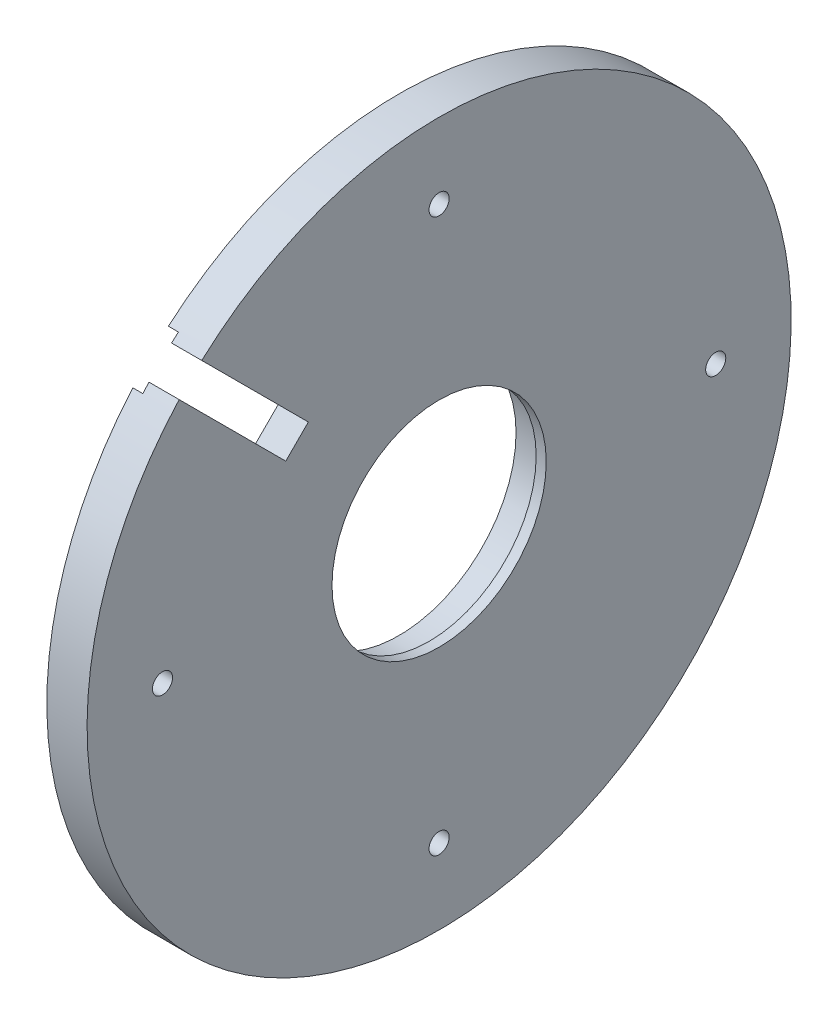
ISO-10303-21;
HEADER;
FILE_DESCRIPTION(('STEP AP214'),'2;1');
FILE_NAME('part.step','',(''),(''),'','','');
FILE_SCHEMA(('AUTOMOTIVE_DESIGN { 1 0 10303 214 1 1 1 1 }'));
ENDSEC;
DATA;
#1=APPLICATION_CONTEXT('core data for automotive mechanical design processes');
#2=APPLICATION_PROTOCOL_DEFINITION('international standard','automotive_design',2000,#1);
#3=PRODUCT_CONTEXT('',#1,'mechanical');
#4=PRODUCT('Part','Part','',(#3));
#5=PRODUCT_RELATED_PRODUCT_CATEGORY('part','',(#4));
#6=PRODUCT_DEFINITION_FORMATION('','',#4);
#7=PRODUCT_DEFINITION_CONTEXT('part definition',#1,'design');
#8=PRODUCT_DEFINITION('design','',#6,#7);
#9=PRODUCT_DEFINITION_SHAPE('','',#8);
#10=(LENGTH_UNIT() NAMED_UNIT(*) SI_UNIT(.MILLI.,.METRE.));
#11=(NAMED_UNIT(*) PLANE_ANGLE_UNIT() SI_UNIT($,.RADIAN.));
#12=(NAMED_UNIT(*) SI_UNIT($,.STERADIAN.) SOLID_ANGLE_UNIT());
#13=UNCERTAINTY_MEASURE_WITH_UNIT(LENGTH_MEASURE(1.E-05),#10,'distance_accuracy_value','');
#14=(GEOMETRIC_REPRESENTATION_CONTEXT(3) GLOBAL_UNCERTAINTY_ASSIGNED_CONTEXT((#13)) GLOBAL_UNIT_ASSIGNED_CONTEXT((#10,
#11,#12)) REPRESENTATION_CONTEXT('',''));
#15=CARTESIAN_POINT('',(0.,0.,0.));
#16=DIRECTION('',(0.,0.,1.));
#17=DIRECTION('',(1.,0.,0.));
#18=AXIS2_PLACEMENT_3D('',#15,#16,#17);
#19=CARTESIAN_POINT('',(3.,23.4767178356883,24.9582128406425));
#20=DIRECTION('',(-1.,0.,0.));
#21=DIRECTION('',(0.,0.,1.));
#22=AXIS2_PLACEMENT_3D('',#19,#20,#21);
#23=PLANE('',#22);
#24=CARTESIAN_POINT('',(3.,23.4767178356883,24.9582128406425));
#25=DIRECTION('',(-1.,0.,0.));
#26=DIRECTION('',(0.,0.,1.));
#27=AXIS2_PLACEMENT_3D('',#24,#25,#26);
#28=CIRCLE('',#27,10.6500000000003);
#29=CARTESIAN_POINT('',(3.,23.4767178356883,35.6082128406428));
#30=VERTEX_POINT('',#29);
#31=EDGE_CURVE('E169',#30,#30,#28,.T.);
#32=ORIENTED_EDGE('',*,*,#31,.F.);
#33=EDGE_LOOP('',(#32));
#34=FACE_BOUND('',#33,.T.);
#35=CARTESIAN_POINT('',(3.,23.4767178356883,24.9582128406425));
#36=DIRECTION('',(-1.,0.,0.));
#37=DIRECTION('',(0.,0.,1.));
#38=AXIS2_PLACEMENT_3D('',#35,#36,#37);
#39=CIRCLE('',#38,11.1500000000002);
#40=CARTESIAN_POINT('',(3.,23.4767178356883,36.1082128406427));
#41=VERTEX_POINT('',#40);
#42=EDGE_CURVE('E162',#41,#41,#39,.T.);
#43=ORIENTED_EDGE('',*,*,#42,.T.);
#44=EDGE_LOOP('',(#43));
#45=FACE_BOUND('',#44,.T.);
#46=ADVANCED_FACE('F33',(#34,#45),#23,.T.);
#47=CARTESIAN_POINT('',(4.,23.4767178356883,24.9582128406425));
#48=DIRECTION('',(1.,0.,0.));
#49=DIRECTION('',(0.,0.,-1.));
#50=AXIS2_PLACEMENT_3D('',#47,#48,#49);
#51=PLANE('',#50);
#52=DIRECTION('',(0.,-0.707106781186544,-0.707106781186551));
#53=VECTOR('',#52,1.);
#54=CARTESIAN_POINT('',(4.,36.4963214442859,40.2228804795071));
#55=LINE('',#54,#53);
#56=CARTESIAN_POINT('',(4.,47.0774526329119,50.8040116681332));
#57=VERTEX_POINT('',#56);
#58=CARTESIAN_POINT('',(4.,36.4963214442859,40.2228804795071));
#59=VERTEX_POINT('',#58);
#60=EDGE_CURVE('E117',#57,#59,#55,.T.);
#61=ORIENTED_EDGE('',*,*,#60,.F.);
#62=CARTESIAN_POINT('',(4.,23.4767178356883,24.9582128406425));
#63=DIRECTION('',(1.,0.,0.));
#64=DIRECTION('',(0.,0.,-1.));
#65=AXIS2_PLACEMENT_3D('',#62,#63,#64);
#66=CIRCLE('',#65,35.);
#67=CARTESIAN_POINT('',(4.,49.3225166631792,48.5589476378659));
#68=VERTEX_POINT('',#67);
#69=EDGE_CURVE('E194',#57,#68,#66,.T.);
#70=ORIENTED_EDGE('',*,*,#69,.T.);
#71=DIRECTION('',(0.,0.707106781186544,0.707106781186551));
#72=VECTOR('',#71,1.);
#73=CARTESIAN_POINT('',(4.,38.7413854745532,37.9778164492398));
#74=LINE('',#73,#72);
#75=CARTESIAN_POINT('',(4.,38.7236967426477,37.9601277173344));
#76=VERTEX_POINT('',#75);
#77=EDGE_CURVE('E124',#76,#68,#74,.T.);
#78=ORIENTED_EDGE('',*,*,#77,.F.);
#79=DIRECTION('',(0.,0.707106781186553,-0.707106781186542));
#80=VECTOR('',#79,1.);
#81=CARTESIAN_POINT('',(4.,36.4781181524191,40.205706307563));
#82=LINE('',#81,#80);
#83=CARTESIAN_POINT('',(4.,36.4781181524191,40.205706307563));
#84=VERTEX_POINT('',#83);
#85=EDGE_CURVE('E114',#84,#76,#82,.T.);
#86=ORIENTED_EDGE('',*,*,#85,.F.);
#87=DIRECTION('',(0.,-0.72736861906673,-0.686246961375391));
#88=VECTOR('',#87,1.);
#89=CARTESIAN_POINT('',(4.,36.4781181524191,40.205706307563));
#90=LINE('',#89,#88);
#91=EDGE_CURVE('E109',#59,#84,#90,.T.);
#92=ORIENTED_EDGE('',*,*,#91,.F.);
#93=EDGE_LOOP('',(#61,#70,#78,#86,#92));
#94=FACE_BOUND('',#93,.T.);
#95=CARTESIAN_POINT('',(4.,50.9767178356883,24.9582128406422));
#96=DIRECTION('',(1.,0.,0.));
#97=DIRECTION('',(0.,0.,-1.));
#98=AXIS2_PLACEMENT_3D('',#95,#96,#97);
#99=CIRCLE('',#98,1.);
#100=CARTESIAN_POINT('',(4.,50.9767178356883,23.9582128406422));
#101=VERTEX_POINT('',#100);
#102=EDGE_CURVE('E172',#101,#101,#99,.T.);
#103=ORIENTED_EDGE('',*,*,#102,.F.);
#104=EDGE_LOOP('',(#103));
#105=FACE_BOUND('',#104,.T.);
#106=CARTESIAN_POINT('',(4.,23.4767178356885,52.4582128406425));
#107=DIRECTION('',(1.,0.,0.));
#108=DIRECTION('',(0.,0.,-1.));
#109=AXIS2_PLACEMENT_3D('',#106,#107,#108);
#110=CIRCLE('',#109,0.999999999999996);
#111=CARTESIAN_POINT('',(4.,23.4767178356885,51.4582128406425));
#112=VERTEX_POINT('',#111);
#113=EDGE_CURVE('E178',#112,#112,#110,.T.);
#114=ORIENTED_EDGE('',*,*,#113,.F.);
#115=EDGE_LOOP('',(#114));
#116=FACE_BOUND('',#115,.T.);
#117=CARTESIAN_POINT('',(4.,-4.02328216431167,24.9582128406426));
#118=DIRECTION('',(1.,0.,0.));
#119=DIRECTION('',(0.,0.,-1.));
#120=AXIS2_PLACEMENT_3D('',#117,#118,#119);
#121=CIRCLE('',#120,1.);
#122=CARTESIAN_POINT('',(4.,-4.02328216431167,23.9582128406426));
#123=VERTEX_POINT('',#122);
#124=EDGE_CURVE('E182',#123,#123,#121,.T.);
#125=ORIENTED_EDGE('',*,*,#124,.F.);
#126=EDGE_LOOP('',(#125));
#127=FACE_BOUND('',#126,.T.);
#128=CARTESIAN_POINT('',(4.,23.4767178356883,-2.54178715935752));
#129=DIRECTION('',(1.,0.,0.));
#130=DIRECTION('',(0.,0.,-1.));
#131=AXIS2_PLACEMENT_3D('',#128,#129,#130);
#132=CIRCLE('',#131,1.);
#133=CARTESIAN_POINT('',(4.,23.4767178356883,-3.54178715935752));
#134=VERTEX_POINT('',#133);
#135=EDGE_CURVE('E186',#134,#134,#132,.T.);
#136=ORIENTED_EDGE('',*,*,#135,.F.);
#137=EDGE_LOOP('',(#136));
#138=FACE_BOUND('',#137,.T.);
#139=CARTESIAN_POINT('',(4.,23.4767178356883,24.9582128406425));
#140=DIRECTION('',(-1.,0.,0.));
#141=DIRECTION('',(0.,0.,1.));
#142=AXIS2_PLACEMENT_3D('',#139,#140,#141);
#143=CIRCLE('',#142,10.6500000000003);
#144=CARTESIAN_POINT('',(4.,23.4767178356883,35.6082128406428));
#145=VERTEX_POINT('',#144);
#146=EDGE_CURVE('E168',#145,#145,#143,.T.);
#147=ORIENTED_EDGE('',*,*,#146,.T.);
#148=EDGE_LOOP('',(#147));
#149=FACE_BOUND('',#148,.T.);
#150=ADVANCED_FACE('F126',(#94,#105,#116,#127,#138,#149),#51,.T.);
#151=CARTESIAN_POINT('',(0.,23.4767178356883,24.9582128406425));
#152=DIRECTION('',(1.,0.,0.));
#153=DIRECTION('',(0.,0.,-1.));
#154=AXIS2_PLACEMENT_3D('',#151,#152,#153);
#155=PLANE('',#154);
#156=CARTESIAN_POINT('',(0.,50.9767178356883,24.9582128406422));
#157=DIRECTION('',(1.,0.,0.));
#158=DIRECTION('',(0.,0.,-1.));
#159=AXIS2_PLACEMENT_3D('',#156,#157,#158);
#160=CIRCLE('',#159,1.);
#161=CARTESIAN_POINT('',(0.,50.9767178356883,23.9582128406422));
#162=VERTEX_POINT('',#161);
#163=EDGE_CURVE('E177',#162,#162,#160,.T.);
#164=ORIENTED_EDGE('',*,*,#163,.T.);
#165=EDGE_LOOP('',(#164));
#166=FACE_BOUND('',#165,.T.);
#167=CARTESIAN_POINT('',(0.,23.4767178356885,52.4582128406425));
#168=DIRECTION('',(1.,0.,0.));
#169=DIRECTION('',(0.,0.,-1.));
#170=AXIS2_PLACEMENT_3D('',#167,#168,#169);
#171=CIRCLE('',#170,0.999999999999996);
#172=CARTESIAN_POINT('',(0.,23.4767178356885,51.4582128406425));
#173=VERTEX_POINT('',#172);
#174=EDGE_CURVE('E181',#173,#173,#171,.T.);
#175=ORIENTED_EDGE('',*,*,#174,.T.);
#176=EDGE_LOOP('',(#175));
#177=FACE_BOUND('',#176,.T.);
#178=CARTESIAN_POINT('',(0.,-4.02328216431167,24.9582128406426));
#179=DIRECTION('',(1.,0.,0.));
#180=DIRECTION('',(0.,0.,-1.));
#181=AXIS2_PLACEMENT_3D('',#178,#179,#180);
#182=CIRCLE('',#181,1.);
#183=CARTESIAN_POINT('',(0.,-4.02328216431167,23.9582128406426));
#184=VERTEX_POINT('',#183);
#185=EDGE_CURVE('E185',#184,#184,#182,.T.);
#186=ORIENTED_EDGE('',*,*,#185,.T.);
#187=EDGE_LOOP('',(#186));
#188=FACE_BOUND('',#187,.T.);
#189=CARTESIAN_POINT('',(0.,23.4767178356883,-2.54178715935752));
#190=DIRECTION('',(1.,0.,0.));
#191=DIRECTION('',(0.,0.,-1.));
#192=AXIS2_PLACEMENT_3D('',#189,#190,#191);
#193=CIRCLE('',#192,1.);
#194=CARTESIAN_POINT('',(0.,23.4767178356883,-3.54178715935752));
#195=VERTEX_POINT('',#194);
#196=EDGE_CURVE('E189',#195,#195,#193,.T.);
#197=ORIENTED_EDGE('',*,*,#196,.T.);
#198=EDGE_LOOP('',(#197));
#199=FACE_BOUND('',#198,.T.);
#200=DIRECTION('',(0.,-0.707106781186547,0.707106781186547));
#201=VECTOR('',#200,1.);
#202=CARTESIAN_POINT('',(0.,37.6011647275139,35.5471258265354));
#203=LINE('',#202,#201);
#204=CARTESIAN_POINT('',(0.,37.6011647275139,35.5471258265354));
#205=VERTEX_POINT('',#204);
#206=CARTESIAN_POINT('',(0.,34.0656308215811,39.0826597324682));
#207=VERTEX_POINT('',#206);
#208=EDGE_CURVE('E140',#205,#207,#203,.T.);
#209=ORIENTED_EDGE('',*,*,#208,.F.);
#210=DIRECTION('',(0.,-0.707106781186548,-0.707106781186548));
#211=VECTOR('',#210,1.);
#212=CARTESIAN_POINT('',(0.,38.3082715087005,36.254232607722));
#213=LINE('',#212,#211);
#214=CARTESIAN_POINT('',(0.,49.9300068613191,47.8759679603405));
#215=VERTEX_POINT('',#214);
#216=EDGE_CURVE('E144',#215,#205,#213,.T.);
#217=ORIENTED_EDGE('',*,*,#216,.F.);
#218=CARTESIAN_POINT('',(0.,23.4767178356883,24.9582128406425));
#219=DIRECTION('',(1.,0.,0.));
#220=DIRECTION('',(0.,0.,-1.));
#221=AXIS2_PLACEMENT_3D('',#218,#219,#220);
#222=CIRCLE('',#221,35.);
#223=CARTESIAN_POINT('',(0.,46.3944729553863,51.4115018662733));
#224=VERTEX_POINT('',#223);
#225=EDGE_CURVE('E193',#224,#215,#222,.T.);
#226=ORIENTED_EDGE('',*,*,#225,.F.);
#227=DIRECTION('',(0.,0.707106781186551,0.707106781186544));
#228=VECTOR('',#227,1.);
#229=CARTESIAN_POINT('',(0.,47.5082448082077,52.5252737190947));
#230=LINE('',#229,#228);
#231=EDGE_CURVE('E152',#207,#224,#230,.T.);
#232=ORIENTED_EDGE('',*,*,#231,.F.);
#233=EDGE_LOOP('',(#209,#217,#226,#232));
#234=FACE_BOUND('',#233,.T.);
#235=CARTESIAN_POINT('',(0.,23.4767178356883,24.9582128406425));
#236=DIRECTION('',(1.,0.,0.));
#237=DIRECTION('',(0.,0.,-1.));
#238=AXIS2_PLACEMENT_3D('',#235,#236,#237);
#239=CIRCLE('',#238,11.6500000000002);
#240=CARTESIAN_POINT('',(0.,23.4767178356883,13.3082128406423));
#241=VERTEX_POINT('',#240);
#242=EDGE_CURVE('E190',#241,#241,#239,.T.);
#243=ORIENTED_EDGE('',*,*,#242,.T.);
#244=EDGE_LOOP('',(#243));
#245=FACE_BOUND('',#244,.T.);
#246=ADVANCED_FACE('F239',(#166,#177,#188,#199,#234,#245),#155,.F.);
#247=CARTESIAN_POINT('',(4.,23.4767178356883,24.9582128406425));
#248=DIRECTION('',(-1.,0.,0.));
#249=DIRECTION('',(0.,0.,1.));
#250=AXIS2_PLACEMENT_3D('',#247,#248,#249);
#251=CYLINDRICAL_SURFACE('',#250,35.);
#252=ORIENTED_EDGE('',*,*,#69,.F.);
#253=DIRECTION('',(-1.,0.,0.));
#254=VECTOR('',#253,1.);
#255=CARTESIAN_POINT('',(4.,47.0774526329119,50.8040116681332));
#256=LINE('',#255,#254);
#257=CARTESIAN_POINT('',(1.,47.0774526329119,50.8040116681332));
#258=VERTEX_POINT('',#257);
#259=EDGE_CURVE('E120',#57,#258,#256,.T.);
#260=ORIENTED_EDGE('',*,*,#259,.T.);
#261=CARTESIAN_POINT('',(1.,23.4767178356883,24.9582128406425));
#262=DIRECTION('',(-1.,0.,0.));
#263=DIRECTION('',(0.,0.,1.));
#264=AXIS2_PLACEMENT_3D('',#261,#262,#263);
#265=CIRCLE('',#264,35.);
#266=CARTESIAN_POINT('',(1.,46.3944729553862,51.4115018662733));
#267=VERTEX_POINT('',#266);
#268=EDGE_CURVE('E161',#267,#258,#265,.T.);
#269=ORIENTED_EDGE('',*,*,#268,.F.);
#270=DIRECTION('',(-1.,0.,0.));
#271=VECTOR('',#270,1.);
#272=CARTESIAN_POINT('',(4.,46.3944729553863,51.4115018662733));
#273=LINE('',#272,#271);
#274=EDGE_CURVE('E56',#267,#224,#273,.T.);
#275=ORIENTED_EDGE('',*,*,#274,.T.);
#276=ORIENTED_EDGE('',*,*,#225,.T.);
#277=DIRECTION('',(-1.,0.,0.));
#278=VECTOR('',#277,1.);
#279=CARTESIAN_POINT('',(4.,49.9300068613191,47.8759679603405));
#280=LINE('',#279,#278);
#281=CARTESIAN_POINT('',(1.,49.930006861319,47.8759679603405));
#282=VERTEX_POINT('',#281);
#283=EDGE_CURVE('E212',#215,#282,#280,.F.);
#284=ORIENTED_EDGE('',*,*,#283,.T.);
#285=CARTESIAN_POINT('',(1.,49.3225166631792,48.5589476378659));
#286=VERTEX_POINT('',#285);
#287=EDGE_CURVE('E157',#286,#282,#265,.T.);
#288=ORIENTED_EDGE('',*,*,#287,.F.);
#289=DIRECTION('',(-1.,0.,0.));
#290=VECTOR('',#289,1.);
#291=CARTESIAN_POINT('',(4.,49.3225166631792,48.5589476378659));
#292=LINE('',#291,#290);
#293=EDGE_CURVE('E48',#286,#68,#292,.F.);
#294=ORIENTED_EDGE('',*,*,#293,.T.);
#295=EDGE_LOOP('',(#252,#260,#269,#275,#276,#284,#288,#294));
#296=FACE_BOUND('',#295,.T.);
#297=ADVANCED_FACE('F228',(#296),#251,.T.);
#298=CARTESIAN_POINT('',(4.,23.4767178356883,24.9582128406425));
#299=DIRECTION('',(-1.,0.,0.));
#300=DIRECTION('',(0.,0.,1.));
#301=AXIS2_PLACEMENT_3D('',#298,#299,#300);
#302=CYLINDRICAL_SURFACE('',#301,11.6500000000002);
#303=ORIENTED_EDGE('',*,*,#242,.F.);
#304=EDGE_LOOP('',(#303));
#305=FACE_BOUND('',#304,.T.);
#306=CARTESIAN_POINT('',(3.25,23.4767178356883,24.9582128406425));
#307=DIRECTION('',(-1.,0.,0.));
#308=DIRECTION('',(0.,0.,1.));
#309=AXIS2_PLACEMENT_3D('',#306,#307,#308);
#310=CIRCLE('',#309,11.6500000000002);
#311=CARTESIAN_POINT('',(3.25,23.4767178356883,36.6082128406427));
#312=VERTEX_POINT('',#311);
#313=EDGE_CURVE('E165',#312,#312,#310,.T.);
#314=ORIENTED_EDGE('',*,*,#313,.F.);
#315=EDGE_LOOP('',(#314));
#316=FACE_BOUND('',#315,.T.);
#317=ADVANCED_FACE('F283',(#305,#316),#302,.F.);
#318=CARTESIAN_POINT('',(-6.,23.4767178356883,-2.54178715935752));
#319=DIRECTION('',(1.,0.,0.));
#320=DIRECTION('',(0.,0.,-1.));
#321=AXIS2_PLACEMENT_3D('',#318,#319,#320);
#322=CYLINDRICAL_SURFACE('',#321,1.);
#323=ORIENTED_EDGE('',*,*,#135,.T.);
#324=EDGE_LOOP('',(#323));
#325=FACE_BOUND('',#324,.T.);
#326=ORIENTED_EDGE('',*,*,#196,.F.);
#327=EDGE_LOOP('',(#326));
#328=FACE_BOUND('',#327,.T.);
#329=ADVANCED_FACE('F279',(#325,#328),#322,.F.);
#330=CARTESIAN_POINT('',(-6.,-4.02328216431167,24.9582128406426));
#331=DIRECTION('',(1.,0.,0.));
#332=DIRECTION('',(0.,0.,-1.));
#333=AXIS2_PLACEMENT_3D('',#330,#331,#332);
#334=CYLINDRICAL_SURFACE('',#333,1.);
#335=ORIENTED_EDGE('',*,*,#124,.T.);
#336=EDGE_LOOP('',(#335));
#337=FACE_BOUND('',#336,.T.);
#338=ORIENTED_EDGE('',*,*,#185,.F.);
#339=EDGE_LOOP('',(#338));
#340=FACE_BOUND('',#339,.T.);
#341=ADVANCED_FACE('F275',(#337,#340),#334,.F.);
#342=CARTESIAN_POINT('',(-6.,23.4767178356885,52.4582128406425));
#343=DIRECTION('',(1.,0.,0.));
#344=DIRECTION('',(0.,0.,-1.));
#345=AXIS2_PLACEMENT_3D('',#342,#343,#344);
#346=CYLINDRICAL_SURFACE('',#345,0.999999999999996);
#347=ORIENTED_EDGE('',*,*,#113,.T.);
#348=EDGE_LOOP('',(#347));
#349=FACE_BOUND('',#348,.T.);
#350=ORIENTED_EDGE('',*,*,#174,.F.);
#351=EDGE_LOOP('',(#350));
#352=FACE_BOUND('',#351,.T.);
#353=ADVANCED_FACE('F271',(#349,#352),#346,.F.);
#354=CARTESIAN_POINT('',(-6.,50.9767178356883,24.9582128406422));
#355=DIRECTION('',(1.,0.,0.));
#356=DIRECTION('',(0.,0.,-1.));
#357=AXIS2_PLACEMENT_3D('',#354,#355,#356);
#358=CYLINDRICAL_SURFACE('',#357,1.);
#359=ORIENTED_EDGE('',*,*,#102,.T.);
#360=EDGE_LOOP('',(#359));
#361=FACE_BOUND('',#360,.T.);
#362=ORIENTED_EDGE('',*,*,#163,.F.);
#363=EDGE_LOOP('',(#362));
#364=FACE_BOUND('',#363,.T.);
#365=ADVANCED_FACE('F268',(#361,#364),#358,.F.);
#366=CARTESIAN_POINT('',(3.,23.4767178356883,24.9582128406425));
#367=DIRECTION('',(1.,0.,0.));
#368=DIRECTION('',(0.,0.,-1.));
#369=AXIS2_PLACEMENT_3D('',#366,#367,#368);
#370=CYLINDRICAL_SURFACE('',#369,10.6500000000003);
#371=ORIENTED_EDGE('',*,*,#31,.T.);
#372=EDGE_LOOP('',(#371));
#373=FACE_BOUND('',#372,.T.);
#374=ORIENTED_EDGE('',*,*,#146,.F.);
#375=EDGE_LOOP('',(#374));
#376=FACE_BOUND('',#375,.T.);
#377=ADVANCED_FACE('F266',(#373,#376),#370,.F.);
#378=CARTESIAN_POINT('',(3.25,23.4767178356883,24.9582128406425));
#379=DIRECTION('',(-1.,0.,0.));
#380=DIRECTION('',(0.,0.,1.));
#381=AXIS2_PLACEMENT_3D('',#378,#379,#380);
#382=PLANE('',#381);
#383=CARTESIAN_POINT('',(3.25,23.4767178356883,24.9582128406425));
#384=DIRECTION('',(-1.,0.,0.));
#385=DIRECTION('',(0.,0.,1.));
#386=AXIS2_PLACEMENT_3D('',#383,#384,#385);
#387=CIRCLE('',#386,11.2500000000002);
#388=CARTESIAN_POINT('',(3.25,23.4767178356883,36.2082128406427));
#389=VERTEX_POINT('',#388);
#390=EDGE_CURVE('E209',#389,#389,#387,.F.);
#391=ORIENTED_EDGE('',*,*,#390,.T.);
#392=EDGE_LOOP('',(#391));
#393=FACE_BOUND('',#392,.T.);
#394=ORIENTED_EDGE('',*,*,#313,.T.);
#395=EDGE_LOOP('',(#394));
#396=FACE_BOUND('',#395,.T.);
#397=ADVANCED_FACE('F324',(#393,#396),#382,.T.);
#398=CARTESIAN_POINT('',(3.25,23.4767178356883,24.9582128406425));
#399=DIRECTION('',(-1.,0.,0.));
#400=DIRECTION('',(0.,0.,1.));
#401=AXIS2_PLACEMENT_3D('',#398,#399,#400);
#402=CYLINDRICAL_SURFACE('',#401,11.1500000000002);
#403=CARTESIAN_POINT('',(3.15,23.4767178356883,24.9582128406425));
#404=DIRECTION('',(-1.,0.,0.));
#405=DIRECTION('',(0.,0.,1.));
#406=AXIS2_PLACEMENT_3D('',#403,#404,#405);
#407=CIRCLE('',#406,11.1500000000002);
#408=CARTESIAN_POINT('',(3.15,23.4767178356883,36.1082128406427));
#409=VERTEX_POINT('',#408);
#410=EDGE_CURVE('E196',#409,#409,#407,.T.);
#411=ORIENTED_EDGE('',*,*,#410,.T.);
#412=EDGE_LOOP('',(#411));
#413=FACE_BOUND('',#412,.T.);
#414=ORIENTED_EDGE('',*,*,#42,.F.);
#415=EDGE_LOOP('',(#414));
#416=FACE_BOUND('',#415,.T.);
#417=ADVANCED_FACE('F330',(#413,#416),#402,.T.);
#418=CARTESIAN_POINT('',(3.15,23.4767178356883,24.9582128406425));
#419=DIRECTION('',(-1.,0.,0.));
#420=DIRECTION('',(0.,0.,1.));
#421=AXIS2_PLACEMENT_3D('',#418,#419,#420);
#422=TOROIDAL_SURFACE('',#421,11.2500000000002,0.1);
#423=ORIENTED_EDGE('',*,*,#390,.F.);
#424=EDGE_LOOP('',(#423));
#425=FACE_BOUND('',#424,.T.);
#426=ORIENTED_EDGE('',*,*,#410,.F.);
#427=EDGE_LOOP('',(#426));
#428=FACE_BOUND('',#427,.T.);
#429=ADVANCED_FACE('F35',(#425,#428),#422,.F.);
#430=CARTESIAN_POINT('',(1.,38.3082715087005,36.254232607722));
#431=DIRECTION('',(0.,0.707106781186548,-0.707106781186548));
#432=DIRECTION('',(0.,0.707106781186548,0.707106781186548));
#433=AXIS2_PLACEMENT_3D('',#430,#431,#432);
#434=PLANE('',#433);
#435=ORIENTED_EDGE('',*,*,#216,.T.);
#436=DIRECTION('',(-1.,0.,0.));
#437=VECTOR('',#436,1.);
#438=CARTESIAN_POINT('',(1.,37.6011647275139,35.5471258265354));
#439=LINE('',#438,#437);
#440=CARTESIAN_POINT('',(1.,37.6011647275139,35.5471258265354));
#441=VERTEX_POINT('',#440);
#442=EDGE_CURVE('E149',#441,#205,#439,.T.);
#443=ORIENTED_EDGE('',*,*,#442,.F.);
#444=DIRECTION('',(0.,-0.707106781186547,-0.707106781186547));
#445=VECTOR('',#444,1.);
#446=CARTESIAN_POINT('',(1.,38.3082715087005,36.254232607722));
#447=LINE('',#446,#445);
#448=EDGE_CURVE('E141',#282,#441,#447,.T.);
#449=ORIENTED_EDGE('',*,*,#448,.F.);
#450=ORIENTED_EDGE('',*,*,#283,.F.);
#451=EDGE_LOOP('',(#435,#443,#449,#450));
#452=FACE_BOUND('',#451,.T.);
#453=ADVANCED_FACE('F235',(#452),#434,.F.);
#454=CARTESIAN_POINT('',(1.,47.5082448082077,52.5252737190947));
#455=DIRECTION('',(0.,-0.707106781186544,0.707106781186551));
#456=DIRECTION('',(0.,-0.707106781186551,-0.707106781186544));
#457=AXIS2_PLACEMENT_3D('',#454,#455,#456);
#458=PLANE('',#457);
#459=DIRECTION('',(0.,0.707106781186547,0.707106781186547));
#460=VECTOR('',#459,1.);
#461=CARTESIAN_POINT('',(1.,34.7727376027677,39.7897665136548));
#462=LINE('',#461,#460);
#463=CARTESIAN_POINT('',(1.,34.0656308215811,39.0826597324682));
#464=VERTEX_POINT('',#463);
#465=EDGE_CURVE('E147',#464,#267,#462,.T.);
#466=ORIENTED_EDGE('',*,*,#465,.F.);
#467=DIRECTION('',(-1.,0.,0.));
#468=VECTOR('',#467,1.);
#469=CARTESIAN_POINT('',(1.,34.0656308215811,39.0826597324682));
#470=LINE('',#469,#468);
#471=EDGE_CURVE('E155',#464,#207,#470,.T.);
#472=ORIENTED_EDGE('',*,*,#471,.T.);
#473=ORIENTED_EDGE('',*,*,#231,.T.);
#474=ORIENTED_EDGE('',*,*,#274,.F.);
#475=EDGE_LOOP('',(#466,#472,#473,#474));
#476=FACE_BOUND('',#475,.T.);
#477=ADVANCED_FACE('F245',(#476),#458,.F.);
#478=CARTESIAN_POINT('',(1.,37.6011647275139,35.5471258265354));
#479=DIRECTION('',(-1.,0.,0.));
#480=DIRECTION('',(0.,0.,1.));
#481=AXIS2_PLACEMENT_3D('',#478,#479,#480);
#482=PLANE('',#481);
#483=DIRECTION('',(0.,0.707106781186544,0.707106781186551));
#484=VECTOR('',#483,1.);
#485=CARTESIAN_POINT('',(1.,34.7108657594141,38.4374247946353));
#486=LINE('',#485,#484);
#487=CARTESIAN_POINT('',(1.,36.4963214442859,40.2228804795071));
#488=VERTEX_POINT('',#487);
#489=EDGE_CURVE('E11',#488,#258,#486,.T.);
#490=ORIENTED_EDGE('',*,*,#489,.F.);
#491=DIRECTION('',(0.,0.72736861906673,0.686246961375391));
#492=VECTOR('',#491,1.);
#493=CARTESIAN_POINT('',(1.,34.7469314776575,38.5723919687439));
#494=LINE('',#493,#492);
#495=CARTESIAN_POINT('',(1.,36.4781181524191,40.205706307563));
#496=VERTEX_POINT('',#495);
#497=EDGE_CURVE('E41',#496,#488,#494,.T.);
#498=ORIENTED_EDGE('',*,*,#497,.F.);
#499=DIRECTION('',(0.,-0.707106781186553,0.707106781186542));
#500=VECTOR('',#499,1.);
#501=CARTESIAN_POINT('',(1.,39.3689316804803,37.3148927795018));
#502=LINE('',#501,#500);
#503=CARTESIAN_POINT('',(1.,38.7236967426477,37.9601277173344));
#504=VERTEX_POINT('',#503);
#505=EDGE_CURVE('E218',#504,#496,#502,.T.);
#506=ORIENTED_EDGE('',*,*,#505,.F.);
#507=DIRECTION('',(0.,-0.707106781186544,-0.707106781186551));
#508=VECTOR('',#507,1.);
#509=CARTESIAN_POINT('',(1.,36.9559297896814,36.192360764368));
#510=LINE('',#509,#508);
#511=EDGE_CURVE('E216',#286,#504,#510,.T.);
#512=ORIENTED_EDGE('',*,*,#511,.F.);
#513=ORIENTED_EDGE('',*,*,#287,.T.);
#514=ORIENTED_EDGE('',*,*,#448,.T.);
#515=DIRECTION('',(0.,-0.707106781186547,0.707106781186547));
#516=VECTOR('',#515,1.);
#517=CARTESIAN_POINT('',(1.,37.6011647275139,35.5471258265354));
#518=LINE('',#517,#516);
#519=EDGE_CURVE('E143',#441,#464,#518,.T.);
#520=ORIENTED_EDGE('',*,*,#519,.T.);
#521=ORIENTED_EDGE('',*,*,#465,.T.);
#522=ORIENTED_EDGE('',*,*,#268,.T.);
#523=EDGE_LOOP('',(#490,#498,#506,#512,#513,#514,#520,#521,#522));
#524=FACE_BOUND('',#523,.T.);
#525=ADVANCED_FACE('F224',(#524),#482,.T.);
#526=CARTESIAN_POINT('',(1.,37.6011647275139,35.5471258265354));
#527=DIRECTION('',(0.,-0.707106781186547,-0.707106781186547));
#528=DIRECTION('',(0.,0.707106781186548,-0.707106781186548));
#529=AXIS2_PLACEMENT_3D('',#526,#527,#528);
#530=PLANE('',#529);
#531=ORIENTED_EDGE('',*,*,#208,.T.);
#532=ORIENTED_EDGE('',*,*,#471,.F.);
#533=ORIENTED_EDGE('',*,*,#519,.F.);
#534=ORIENTED_EDGE('',*,*,#442,.T.);
#535=EDGE_LOOP('',(#531,#532,#533,#534));
#536=FACE_BOUND('',#535,.T.);
#537=ADVANCED_FACE('F243',(#536),#530,.F.);
#538=CARTESIAN_POINT('',(-2.,36.4781181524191,40.205706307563));
#539=DIRECTION('',(0.,-0.707106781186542,-0.707106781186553));
#540=DIRECTION('',(0.,0.707106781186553,-0.707106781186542));
#541=AXIS2_PLACEMENT_3D('',#538,#539,#540);
#542=PLANE('',#541);
#543=ORIENTED_EDGE('',*,*,#85,.T.);
#544=DIRECTION('',(1.,0.,0.));
#545=VECTOR('',#544,1.);
#546=CARTESIAN_POINT('',(-2.,38.7236967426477,37.9601277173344));
#547=LINE('',#546,#545);
#548=EDGE_CURVE('E134',#504,#76,#547,.T.);
#549=ORIENTED_EDGE('',*,*,#548,.F.);
#550=ORIENTED_EDGE('',*,*,#505,.T.);
#551=DIRECTION('',(1.,0.,0.));
#552=VECTOR('',#551,1.);
#553=CARTESIAN_POINT('',(-2.,36.4781181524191,40.205706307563));
#554=LINE('',#553,#552);
#555=EDGE_CURVE('E113',#496,#84,#554,.T.);
#556=ORIENTED_EDGE('',*,*,#555,.T.);
#557=EDGE_LOOP('',(#543,#549,#550,#556));
#558=FACE_BOUND('',#557,.T.);
#559=ADVANCED_FACE('F222',(#558),#542,.F.);
#560=CARTESIAN_POINT('',(-2.,36.4963214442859,40.2228804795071));
#561=DIRECTION('',(0.,-0.707106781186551,0.707106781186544));
#562=DIRECTION('',(0.,-0.707106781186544,-0.707106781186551));
#563=AXIS2_PLACEMENT_3D('',#560,#561,#562);
#564=PLANE('',#563);
#565=ORIENTED_EDGE('',*,*,#60,.T.);
#566=DIRECTION('',(1.,0.,0.));
#567=VECTOR('',#566,1.);
#568=CARTESIAN_POINT('',(-2.,36.4963214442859,40.2228804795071));
#569=LINE('',#568,#567);
#570=EDGE_CURVE('E104',#488,#59,#569,.T.);
#571=ORIENTED_EDGE('',*,*,#570,.F.);
#572=ORIENTED_EDGE('',*,*,#489,.T.);
#573=ORIENTED_EDGE('',*,*,#259,.F.);
#574=EDGE_LOOP('',(#565,#571,#572,#573));
#575=FACE_BOUND('',#574,.T.);
#576=ADVANCED_FACE('F118',(#575),#564,.F.);
#577=CARTESIAN_POINT('',(-2.,38.7413854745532,37.9778164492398));
#578=DIRECTION('',(0.,0.707106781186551,-0.707106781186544));
#579=DIRECTION('',(0.,0.707106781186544,0.707106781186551));
#580=AXIS2_PLACEMENT_3D('',#577,#578,#579);
#581=PLANE('',#580);
#582=ORIENTED_EDGE('',*,*,#511,.T.);
#583=ORIENTED_EDGE('',*,*,#548,.T.);
#584=ORIENTED_EDGE('',*,*,#77,.T.);
#585=ORIENTED_EDGE('',*,*,#293,.F.);
#586=EDGE_LOOP('',(#582,#583,#584,#585));
#587=FACE_BOUND('',#586,.T.);
#588=ADVANCED_FACE('F230',(#587),#581,.F.);
#589=CARTESIAN_POINT('',(-2.,36.4781181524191,40.205706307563));
#590=DIRECTION('',(0.,-0.686246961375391,0.72736861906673));
#591=DIRECTION('',(0.,-0.72736861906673,-0.686246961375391));
#592=AXIS2_PLACEMENT_3D('',#589,#590,#591);
#593=PLANE('',#592);
#594=ORIENTED_EDGE('',*,*,#497,.T.);
#595=ORIENTED_EDGE('',*,*,#570,.T.);
#596=ORIENTED_EDGE('',*,*,#91,.T.);
#597=ORIENTED_EDGE('',*,*,#555,.F.);
#598=EDGE_LOOP('',(#594,#595,#596,#597));
#599=FACE_BOUND('',#598,.T.);
#600=ADVANCED_FACE('F106',(#599),#593,.F.);
#601=CLOSED_SHELL('',(#46,#150,#246,#297,#317,#329,#341,#353,#365,#377,#397,#417,#429,#453,#477,
#525,#537,#559,#576,#588,#600));
#602=MANIFOLD_SOLID_BREP('B2',#601);
#603=ADVANCED_BREP_SHAPE_REPRESENTATION('',(#18,#602),#14);
#604=SHAPE_DEFINITION_REPRESENTATION(#9,#603);
ENDSEC;
END-ISO-10303-21;
